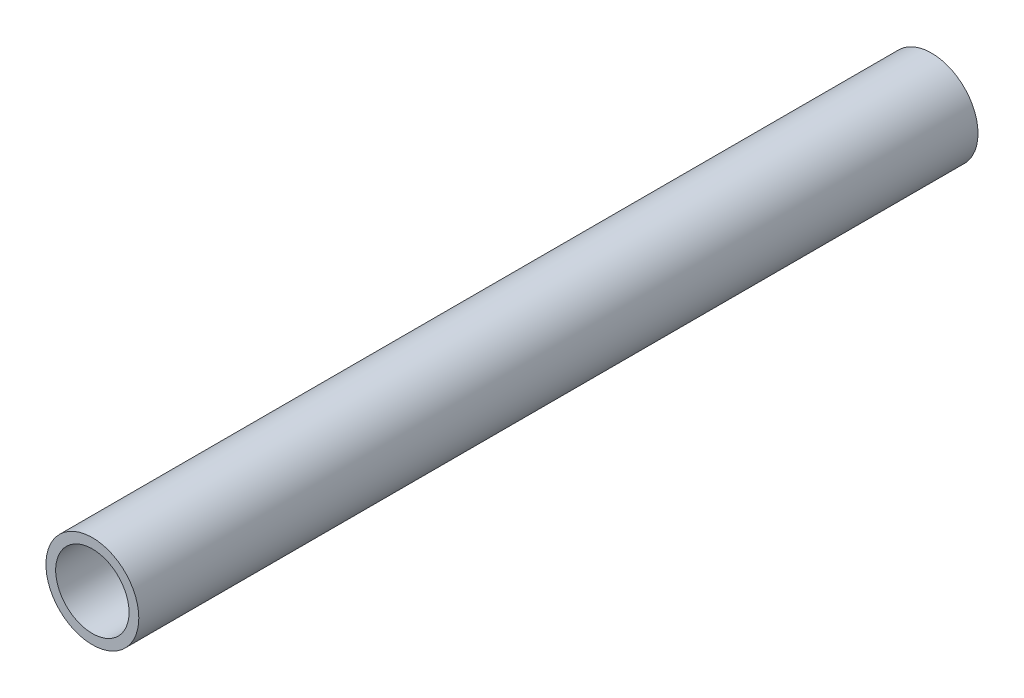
ISO-10303-21;
HEADER;
FILE_DESCRIPTION(('STEP AP214'),'2;1');
FILE_NAME('part.step','',(''),(''),'','','');
FILE_SCHEMA(('AUTOMOTIVE_DESIGN { 1 0 10303 214 1 1 1 1 }'));
ENDSEC;
DATA;
#1=APPLICATION_CONTEXT('core data for automotive mechanical design processes');
#2=APPLICATION_PROTOCOL_DEFINITION('international standard','automotive_design',2000,#1);
#3=PRODUCT_CONTEXT('',#1,'mechanical');
#4=PRODUCT('Part','Part','',(#3));
#5=PRODUCT_RELATED_PRODUCT_CATEGORY('part','',(#4));
#6=PRODUCT_DEFINITION_FORMATION('','',#4);
#7=PRODUCT_DEFINITION_CONTEXT('part definition',#1,'design');
#8=PRODUCT_DEFINITION('design','',#6,#7);
#9=PRODUCT_DEFINITION_SHAPE('','',#8);
#10=(LENGTH_UNIT() NAMED_UNIT(*) SI_UNIT(.MILLI.,.METRE.));
#11=(NAMED_UNIT(*) PLANE_ANGLE_UNIT() SI_UNIT($,.RADIAN.));
#12=(NAMED_UNIT(*) SI_UNIT($,.STERADIAN.) SOLID_ANGLE_UNIT());
#13=UNCERTAINTY_MEASURE_WITH_UNIT(LENGTH_MEASURE(1.E-05),#10,'distance_accuracy_value','');
#14=(GEOMETRIC_REPRESENTATION_CONTEXT(3) GLOBAL_UNCERTAINTY_ASSIGNED_CONTEXT((#13)) GLOBAL_UNIT_ASSIGNED_CONTEXT((#10,
#11,#12)) REPRESENTATION_CONTEXT('',''));
#15=CARTESIAN_POINT('',(0.,0.,0.));
#16=DIRECTION('',(0.,0.,1.));
#17=DIRECTION('',(1.,0.,0.));
#18=AXIS2_PLACEMENT_3D('',#15,#16,#17);
#19=CARTESIAN_POINT('',(0.,0.,-152.4));
#20=DIRECTION('',(0.,0.,1.));
#21=DIRECTION('',(1.,0.,0.));
#22=AXIS2_PLACEMENT_3D('',#19,#20,#21);
#23=CYLINDRICAL_SURFACE('',#22,16.8671875);
#24=CARTESIAN_POINT('',(0.,0.,-152.4));
#25=DIRECTION('',(0.,0.,1.));
#26=DIRECTION('',(1.,0.,0.));
#27=AXIS2_PLACEMENT_3D('',#24,#25,#26);
#28=CIRCLE('',#27,16.8671875);
#29=CARTESIAN_POINT('',(16.8671875,0.,-152.4));
#30=VERTEX_POINT('',#29);
#31=EDGE_CURVE('E10',#30,#30,#28,.T.);
#32=ORIENTED_EDGE('',*,*,#31,.T.);
#33=EDGE_LOOP('',(#32));
#34=FACE_BOUND('',#33,.T.);
#35=CARTESIAN_POINT('',(0.,0.,152.4));
#36=DIRECTION('',(0.,0.,1.));
#37=DIRECTION('',(1.,0.,0.));
#38=AXIS2_PLACEMENT_3D('',#35,#36,#37);
#39=CIRCLE('',#38,16.8671875);
#40=CARTESIAN_POINT('',(16.8671875,0.,152.4));
#41=VERTEX_POINT('',#40);
#42=EDGE_CURVE('E42',#41,#41,#39,.T.);
#43=ORIENTED_EDGE('',*,*,#42,.F.);
#44=EDGE_LOOP('',(#43));
#45=FACE_BOUND('',#44,.T.);
#46=ADVANCED_FACE('F32',(#34,#45),#23,.T.);
#47=CARTESIAN_POINT('',(0.,0.,-152.4));
#48=DIRECTION('',(0.,0.,1.));
#49=DIRECTION('',(1.,0.,0.));
#50=AXIS2_PLACEMENT_3D('',#47,#48,#49);
#51=PLANE('',#50);
#52=CARTESIAN_POINT('',(0.,0.,-152.4));
#53=DIRECTION('',(0.,0.,1.));
#54=DIRECTION('',(1.,0.,0.));
#55=AXIS2_PLACEMENT_3D('',#52,#53,#54);
#56=CIRCLE('',#55,13.3223);
#57=CARTESIAN_POINT('',(13.3223,0.,-152.4));
#58=VERTEX_POINT('',#57);
#59=EDGE_CURVE('E38',#58,#58,#56,.T.);
#60=ORIENTED_EDGE('',*,*,#59,.T.);
#61=EDGE_LOOP('',(#60));
#62=FACE_BOUND('',#61,.T.);
#63=ORIENTED_EDGE('',*,*,#31,.F.);
#64=EDGE_LOOP('',(#63));
#65=FACE_BOUND('',#64,.T.);
#66=ADVANCED_FACE('F61',(#62,#65),#51,.F.);
#67=CARTESIAN_POINT('',(0.,0.,-152.4));
#68=DIRECTION('',(0.,0.,1.));
#69=DIRECTION('',(1.,0.,0.));
#70=AXIS2_PLACEMENT_3D('',#67,#68,#69);
#71=CYLINDRICAL_SURFACE('',#70,13.3223);
#72=ORIENTED_EDGE('',*,*,#59,.F.);
#73=EDGE_LOOP('',(#72));
#74=FACE_BOUND('',#73,.T.);
#75=CARTESIAN_POINT('',(0.,0.,152.4));
#76=DIRECTION('',(0.,0.,1.));
#77=DIRECTION('',(1.,0.,0.));
#78=AXIS2_PLACEMENT_3D('',#75,#76,#77);
#79=CIRCLE('',#78,13.3223);
#80=CARTESIAN_POINT('',(13.3223,0.,152.4));
#81=VERTEX_POINT('',#80);
#82=EDGE_CURVE('E46',#81,#81,#79,.T.);
#83=ORIENTED_EDGE('',*,*,#82,.T.);
#84=EDGE_LOOP('',(#83));
#85=FACE_BOUND('',#84,.T.);
#86=ADVANCED_FACE('F52',(#74,#85),#71,.F.);
#87=CARTESIAN_POINT('',(0.,0.,152.4));
#88=DIRECTION('',(0.,0.,1.));
#89=DIRECTION('',(1.,0.,0.));
#90=AXIS2_PLACEMENT_3D('',#87,#88,#89);
#91=PLANE('',#90);
#92=ORIENTED_EDGE('',*,*,#42,.T.);
#93=EDGE_LOOP('',(#92));
#94=FACE_BOUND('',#93,.T.);
#95=ORIENTED_EDGE('',*,*,#82,.F.);
#96=EDGE_LOOP('',(#95));
#97=FACE_BOUND('',#96,.T.);
#98=ADVANCED_FACE('F54',(#94,#97),#91,.T.);
#99=CLOSED_SHELL('',(#46,#66,#86,#98));
#100=MANIFOLD_SOLID_BREP('B2',#99);
#101=ADVANCED_BREP_SHAPE_REPRESENTATION('',(#18,#100),#14);
#102=SHAPE_DEFINITION_REPRESENTATION(#9,#101);
ENDSEC;
END-ISO-10303-21;
